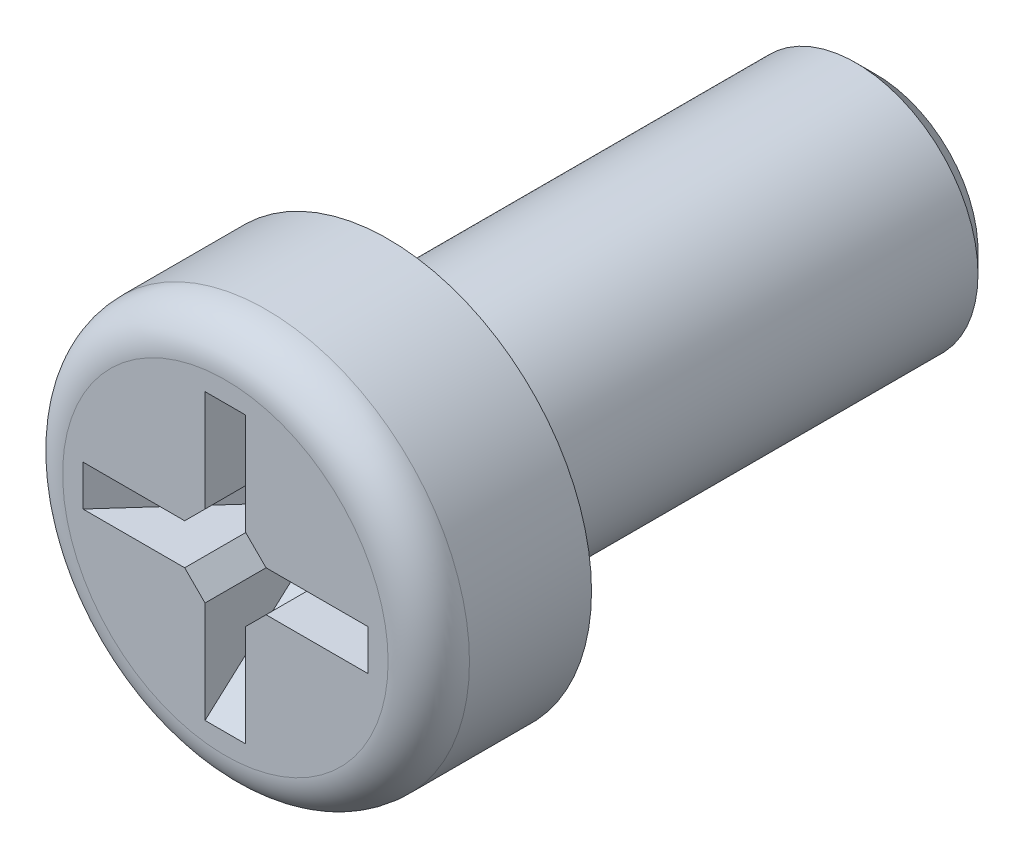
ISO-10303-21;
HEADER;
FILE_DESCRIPTION(('STEP AP214'),'2;1');
FILE_NAME('part.step','',(''),(''),'','','');
FILE_SCHEMA(('AUTOMOTIVE_DESIGN { 1 0 10303 214 1 1 1 1 }'));
ENDSEC;
DATA;
#1=APPLICATION_CONTEXT('core data for automotive mechanical design processes');
#2=APPLICATION_PROTOCOL_DEFINITION('international standard','automotive_design',2000,#1);
#3=PRODUCT_CONTEXT('',#1,'mechanical');
#4=PRODUCT('Part','Part','',(#3));
#5=PRODUCT_RELATED_PRODUCT_CATEGORY('part','',(#4));
#6=PRODUCT_DEFINITION_FORMATION('','',#4);
#7=PRODUCT_DEFINITION_CONTEXT('part definition',#1,'design');
#8=PRODUCT_DEFINITION('design','',#6,#7);
#9=PRODUCT_DEFINITION_SHAPE('','',#8);
#10=(LENGTH_UNIT() NAMED_UNIT(*) SI_UNIT(.MILLI.,.METRE.));
#11=(NAMED_UNIT(*) PLANE_ANGLE_UNIT() SI_UNIT($,.RADIAN.));
#12=(NAMED_UNIT(*) SI_UNIT($,.STERADIAN.) SOLID_ANGLE_UNIT());
#13=UNCERTAINTY_MEASURE_WITH_UNIT(LENGTH_MEASURE(1.E-05),#10,'distance_accuracy_value','');
#14=(GEOMETRIC_REPRESENTATION_CONTEXT(3) GLOBAL_UNCERTAINTY_ASSIGNED_CONTEXT((#13)) GLOBAL_UNIT_ASSIGNED_CONTEXT((#10,
#11,#12)) REPRESENTATION_CONTEXT('',''));
#15=CARTESIAN_POINT('',(0.,0.,0.));
#16=DIRECTION('',(0.,0.,1.));
#17=DIRECTION('',(1.,0.,0.));
#18=AXIS2_PLACEMENT_3D('',#15,#16,#17);
#19=CARTESIAN_POINT('',(1.75,0.25,2.));
#20=DIRECTION('',(-0.743144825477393,0.,0.669130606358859));
#21=DIRECTION('',(0.669130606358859,0.,0.743144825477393));
#22=AXIS2_PLACEMENT_3D('',#19,#20,#21);
#23=PLANE('',#22);
#24=DIRECTION('',(-0.669130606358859,0.,-0.743144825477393));
#25=VECTOR('',#24,1.);
#26=CARTESIAN_POINT('',(1.75,0.25,2.));
#27=LINE('',#26,#25);
#28=CARTESIAN_POINT('',(0.5,0.25,0.611734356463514));
#29=VERTEX_POINT('',#28);
#30=CARTESIAN_POINT('',(1.75,0.25,2.));
#31=VERTEX_POINT('',#30);
#32=EDGE_CURVE('E219',#29,#31,#27,.F.);
#33=ORIENTED_EDGE('',*,*,#32,.F.);
#34=DIRECTION('',(-0.556117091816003,0.556117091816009,-0.617630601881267));
#35=VECTOR('',#34,1.);
#36=CARTESIAN_POINT('',(1.36341722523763,-0.613417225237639,1.57065633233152));
#37=LINE('',#36,#35);
#38=CARTESIAN_POINT('',(0.375,0.375,0.472907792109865));
#39=VERTEX_POINT('',#38);
#40=EDGE_CURVE('E266',#29,#39,#37,.T.);
#41=ORIENTED_EDGE('',*,*,#40,.T.);
#42=DIRECTION('',(-0.556117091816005,-0.556117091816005,-0.617630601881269));
#43=VECTOR('',#42,1.);
#44=CARTESIAN_POINT('',(1.13146756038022,1.13146756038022,1.31305013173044));
#45=LINE('',#44,#43);
#46=CARTESIAN_POINT('',(0.0392323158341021,0.0392323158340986,0.0999999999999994));
#47=VERTEX_POINT('',#46);
#48=EDGE_CURVE('E238',#39,#47,#45,.T.);
#49=ORIENTED_EDGE('',*,*,#48,.T.);
#50=DIRECTION('',(0.,-1.,0.));
#51=VECTOR('',#50,1.);
#52=CARTESIAN_POINT('',(0.0392323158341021,-0.25,0.0999999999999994));
#53=LINE('',#52,#51);
#54=CARTESIAN_POINT('',(0.0392323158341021,-0.0392323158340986,0.0999999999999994));
#55=VERTEX_POINT('',#54);
#56=EDGE_CURVE('E222',#55,#47,#53,.F.);
#57=ORIENTED_EDGE('',*,*,#56,.F.);
#58=DIRECTION('',(-0.556117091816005,0.556117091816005,-0.617630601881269));
#59=VECTOR('',#58,1.);
#60=CARTESIAN_POINT('',(1.13146756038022,-1.13146756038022,1.31305013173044));
#61=LINE('',#60,#59);
#62=CARTESIAN_POINT('',(0.375,-0.375,0.472907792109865));
#63=VERTEX_POINT('',#62);
#64=EDGE_CURVE('E53',#63,#55,#61,.T.);
#65=ORIENTED_EDGE('',*,*,#64,.F.);
#66=DIRECTION('',(0.556117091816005,0.556117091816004,0.617630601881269));
#67=VECTOR('',#66,1.);
#68=CARTESIAN_POINT('',(1.51805033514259,0.76805033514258,1.74239379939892));
#69=LINE('',#68,#67);
#70=CARTESIAN_POINT('',(0.5,-0.25,0.611734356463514));
#71=VERTEX_POINT('',#70);
#72=EDGE_CURVE('E277',#63,#71,#69,.T.);
#73=ORIENTED_EDGE('',*,*,#72,.T.);
#74=DIRECTION('',(-0.669130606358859,0.,-0.743144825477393));
#75=VECTOR('',#74,1.);
#76=CARTESIAN_POINT('',(0.133600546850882,-0.249999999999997,0.204806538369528));
#77=LINE('',#76,#75);
#78=CARTESIAN_POINT('',(1.75,-0.25,2.));
#79=VERTEX_POINT('',#78);
#80=EDGE_CURVE('E224',#71,#79,#77,.F.);
#81=ORIENTED_EDGE('',*,*,#80,.T.);
#82=DIRECTION('',(0.,1.,0.));
#83=VECTOR('',#82,1.);
#84=CARTESIAN_POINT('',(1.75,0.25,2.));
#85=LINE('',#84,#83);
#86=EDGE_CURVE('E186',#79,#31,#85,.T.);
#87=ORIENTED_EDGE('',*,*,#86,.T.);
#88=EDGE_LOOP('',(#33,#41,#49,#57,#65,#73,#81,#87));
#89=FACE_BOUND('',#88,.T.);
#90=ADVANCED_FACE('F30',(#89),#23,.T.);
#91=CARTESIAN_POINT('',(-0.250000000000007,1.75,2.));
#92=DIRECTION('',(0.,-0.743144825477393,0.669130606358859));
#93=DIRECTION('',(0.,-0.669130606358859,-0.743144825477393));
#94=AXIS2_PLACEMENT_3D('',#91,#92,#93);
#95=PLANE('',#94);
#96=ORIENTED_EDGE('',*,*,#48,.F.);
#97=DIRECTION('',(-0.556117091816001,0.556117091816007,0.61763060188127));
#98=VECTOR('',#97,1.);
#99=CARTESIAN_POINT('',(-0.76805033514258,1.51805033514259,1.74239379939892));
#100=LINE('',#99,#98);
#101=CARTESIAN_POINT('',(0.25,0.5,0.611734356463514));
#102=VERTEX_POINT('',#101);
#103=EDGE_CURVE('E269',#39,#102,#100,.T.);
#104=ORIENTED_EDGE('',*,*,#103,.T.);
#105=DIRECTION('',(0.,-0.669130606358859,-0.743144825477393));
#106=VECTOR('',#105,1.);
#107=CARTESIAN_POINT('',(0.25,0.805204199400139,0.950697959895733));
#108=LINE('',#107,#106);
#109=CARTESIAN_POINT('',(0.250000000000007,1.75,2.));
#110=VERTEX_POINT('',#109);
#111=EDGE_CURVE('E217',#102,#110,#108,.F.);
#112=ORIENTED_EDGE('',*,*,#111,.T.);
#113=DIRECTION('',(-1.,0.,0.));
#114=VECTOR('',#113,1.);
#115=CARTESIAN_POINT('',(-0.250000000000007,1.75,2.));
#116=LINE('',#115,#114);
#117=CARTESIAN_POINT('',(-0.250000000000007,1.75,2.));
#118=VERTEX_POINT('',#117);
#119=EDGE_CURVE('E195',#110,#118,#116,.T.);
#120=ORIENTED_EDGE('',*,*,#119,.T.);
#121=DIRECTION('',(0.,-0.669130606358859,-0.743144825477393));
#122=VECTOR('',#121,1.);
#123=CARTESIAN_POINT('',(-0.250000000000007,1.75,2.));
#124=LINE('',#123,#122);
#125=CARTESIAN_POINT('',(-0.25,0.5,0.611734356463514));
#126=VERTEX_POINT('',#125);
#127=EDGE_CURVE('E203',#126,#118,#124,.F.);
#128=ORIENTED_EDGE('',*,*,#127,.F.);
#129=DIRECTION('',(-0.556117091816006,-0.556117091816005,-0.617630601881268));
#130=VECTOR('',#129,1.);
#131=CARTESIAN_POINT('',(0.613417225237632,1.36341722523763,1.57065633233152));
#132=LINE('',#131,#130);
#133=CARTESIAN_POINT('',(-0.375,0.375,0.472907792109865));
#134=VERTEX_POINT('',#133);
#135=EDGE_CURVE('E271',#126,#134,#132,.T.);
#136=ORIENTED_EDGE('',*,*,#135,.T.);
#137=DIRECTION('',(0.556117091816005,-0.556117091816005,-0.617630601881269));
#138=VECTOR('',#137,1.);
#139=CARTESIAN_POINT('',(-1.28610067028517,1.28610067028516,1.48478759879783));
#140=LINE('',#139,#138);
#141=CARTESIAN_POINT('',(-0.0392323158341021,0.0392323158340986,0.0999999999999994));
#142=VERTEX_POINT('',#141);
#143=EDGE_CURVE('E235',#134,#142,#140,.T.);
#144=ORIENTED_EDGE('',*,*,#143,.T.);
#145=DIRECTION('',(1.,0.,0.));
#146=VECTOR('',#145,1.);
#147=CARTESIAN_POINT('',(-0.25,0.0392323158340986,0.0999999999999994));
#148=LINE('',#147,#146);
#149=EDGE_CURVE('E156',#47,#142,#148,.F.);
#150=ORIENTED_EDGE('',*,*,#149,.F.);
#151=EDGE_LOOP('',(#96,#104,#112,#120,#128,#136,#144,#150));
#152=FACE_BOUND('',#151,.T.);
#153=ADVANCED_FACE('F32',(#152),#95,.T.);
#154=CARTESIAN_POINT('',(-0.250000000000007,-1.75,2.));
#155=DIRECTION('',(0.,0.743144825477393,0.669130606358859));
#156=DIRECTION('',(0.,-0.669130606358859,0.743144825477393));
#157=AXIS2_PLACEMENT_3D('',#154,#155,#156);
#158=PLANE('',#157);
#159=DIRECTION('',(0.,0.669130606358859,-0.743144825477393));
#160=VECTOR('',#159,1.);
#161=CARTESIAN_POINT('',(0.250000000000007,-1.75,2.));
#162=LINE('',#161,#160);
#163=CARTESIAN_POINT('',(0.25,-0.5,0.611734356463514));
#164=VERTEX_POINT('',#163);
#165=CARTESIAN_POINT('',(0.250000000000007,-1.75,2.));
#166=VERTEX_POINT('',#165);
#167=EDGE_CURVE('E226',#164,#166,#162,.F.);
#168=ORIENTED_EDGE('',*,*,#167,.F.);
#169=DIRECTION('',(0.556117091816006,0.556117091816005,-0.617630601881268));
#170=VECTOR('',#169,1.);
#171=CARTESIAN_POINT('',(-0.768050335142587,-1.51805033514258,1.74239379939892));
#172=LINE('',#171,#170);
#173=EDGE_CURVE('E275',#164,#63,#172,.T.);
#174=ORIENTED_EDGE('',*,*,#173,.T.);
#175=ORIENTED_EDGE('',*,*,#64,.T.);
#176=DIRECTION('',(-1.,0.,0.));
#177=VECTOR('',#176,1.);
#178=CARTESIAN_POINT('',(-0.25,-0.0392323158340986,0.0999999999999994));
#179=LINE('',#178,#177);
#180=CARTESIAN_POINT('',(-0.0392323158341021,-0.0392323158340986,0.0999999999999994));
#181=VERTEX_POINT('',#180);
#182=EDGE_CURVE('E214',#181,#55,#179,.F.);
#183=ORIENTED_EDGE('',*,*,#182,.F.);
#184=DIRECTION('',(0.556117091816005,0.556117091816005,-0.617630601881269));
#185=VECTOR('',#184,1.);
#186=CARTESIAN_POINT('',(-1.28610067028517,-1.28610067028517,1.48478759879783));
#187=LINE('',#186,#185);
#188=CARTESIAN_POINT('',(-0.375,-0.375,0.472907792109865));
#189=VERTEX_POINT('',#188);
#190=EDGE_CURVE('E45',#189,#181,#187,.T.);
#191=ORIENTED_EDGE('',*,*,#190,.F.);
#192=DIRECTION('',(0.556117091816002,-0.556117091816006,0.61763060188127));
#193=VECTOR('',#192,1.);
#194=CARTESIAN_POINT('',(0.613417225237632,-1.36341722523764,1.57065633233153));
#195=LINE('',#194,#193);
#196=CARTESIAN_POINT('',(-0.25,-0.5,0.611734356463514));
#197=VERTEX_POINT('',#196);
#198=EDGE_CURVE('E281',#189,#197,#195,.T.);
#199=ORIENTED_EDGE('',*,*,#198,.T.);
#200=DIRECTION('',(0.,0.669130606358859,-0.743144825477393));
#201=VECTOR('',#200,1.);
#202=CARTESIAN_POINT('',(-0.25,-0.133600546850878,0.204806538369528));
#203=LINE('',#202,#201);
#204=CARTESIAN_POINT('',(-0.250000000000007,-1.75,2.));
#205=VERTEX_POINT('',#204);
#206=EDGE_CURVE('E216',#197,#205,#203,.F.);
#207=ORIENTED_EDGE('',*,*,#206,.T.);
#208=DIRECTION('',(1.,0.,0.));
#209=VECTOR('',#208,1.);
#210=CARTESIAN_POINT('',(-0.250000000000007,-1.75,2.));
#211=LINE('',#210,#209);
#212=EDGE_CURVE('E177',#205,#166,#211,.T.);
#213=ORIENTED_EDGE('',*,*,#212,.T.);
#214=EDGE_LOOP('',(#168,#174,#175,#183,#191,#199,#207,#213));
#215=FACE_BOUND('',#214,.T.);
#216=ADVANCED_FACE('F303',(#215),#158,.T.);
#217=CARTESIAN_POINT('',(-1.75,0.25,2.));
#218=DIRECTION('',(0.743144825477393,0.,0.669130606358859));
#219=DIRECTION('',(0.669130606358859,0.,-0.743144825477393));
#220=AXIS2_PLACEMENT_3D('',#217,#218,#219);
#221=PLANE('',#220);
#222=ORIENTED_EDGE('',*,*,#143,.F.);
#223=DIRECTION('',(-0.556117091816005,-0.556117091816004,0.617630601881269));
#224=VECTOR('',#223,1.);
#225=CARTESIAN_POINT('',(-1.36341722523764,-0.613417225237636,1.57065633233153));
#226=LINE('',#225,#224);
#227=CARTESIAN_POINT('',(-0.5,0.25,0.611734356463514));
#228=VERTEX_POINT('',#227);
#229=EDGE_CURVE('E151',#134,#228,#226,.T.);
#230=ORIENTED_EDGE('',*,*,#229,.T.);
#231=DIRECTION('',(0.669130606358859,0.,-0.743144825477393));
#232=VECTOR('',#231,1.);
#233=CARTESIAN_POINT('',(-0.805204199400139,0.25,0.950697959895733));
#234=LINE('',#233,#232);
#235=CARTESIAN_POINT('',(-1.75,0.25,2.));
#236=VERTEX_POINT('',#235);
#237=EDGE_CURVE('E143',#228,#236,#234,.F.);
#238=ORIENTED_EDGE('',*,*,#237,.T.);
#239=DIRECTION('',(0.,-1.,0.));
#240=VECTOR('',#239,1.);
#241=CARTESIAN_POINT('',(-1.75,0.25,2.));
#242=LINE('',#241,#240);
#243=CARTESIAN_POINT('',(-1.75,-0.25,2.));
#244=VERTEX_POINT('',#243);
#245=EDGE_CURVE('E148',#236,#244,#242,.T.);
#246=ORIENTED_EDGE('',*,*,#245,.T.);
#247=DIRECTION('',(0.669130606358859,0.,-0.743144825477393));
#248=VECTOR('',#247,1.);
#249=CARTESIAN_POINT('',(-1.75,-0.25,2.));
#250=LINE('',#249,#248);
#251=CARTESIAN_POINT('',(-0.5,-0.25,0.611734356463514));
#252=VERTEX_POINT('',#251);
#253=EDGE_CURVE('E155',#252,#244,#250,.F.);
#254=ORIENTED_EDGE('',*,*,#253,.F.);
#255=DIRECTION('',(0.556117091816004,-0.556117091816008,-0.617630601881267));
#256=VECTOR('',#255,1.);
#257=CARTESIAN_POINT('',(-1.51805033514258,0.768050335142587,1.74239379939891));
#258=LINE('',#257,#256);
#259=EDGE_CURVE('E279',#252,#189,#258,.T.);
#260=ORIENTED_EDGE('',*,*,#259,.T.);
#261=ORIENTED_EDGE('',*,*,#190,.T.);
#262=DIRECTION('',(0.,1.,0.));
#263=VECTOR('',#262,1.);
#264=CARTESIAN_POINT('',(-0.0392323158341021,-0.25,0.0999999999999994));
#265=LINE('',#264,#263);
#266=EDGE_CURVE('E198',#142,#181,#265,.F.);
#267=ORIENTED_EDGE('',*,*,#266,.F.);
#268=EDGE_LOOP('',(#222,#230,#238,#246,#254,#260,#261,#267));
#269=FACE_BOUND('',#268,.T.);
#270=ADVANCED_FACE('F145',(#269),#221,.T.);
#271=CARTESIAN_POINT('',(0.,0.,0.));
#272=DIRECTION('',(0.,0.,1.));
#273=DIRECTION('',(1.,0.,0.));
#274=AXIS2_PLACEMENT_3D('',#271,#272,#273);
#275=PLANE('',#274);
#276=CARTESIAN_POINT('',(0.,0.,0.));
#277=DIRECTION('',(0.,0.,1.));
#278=DIRECTION('',(1.,0.,0.));
#279=AXIS2_PLACEMENT_3D('',#276,#277,#278);
#280=CIRCLE('',#279,2.5);
#281=CARTESIAN_POINT('',(2.5,0.,0.));
#282=VERTEX_POINT('',#281);
#283=EDGE_CURVE('E199',#282,#282,#280,.T.);
#284=ORIENTED_EDGE('',*,*,#283,.F.);
#285=EDGE_LOOP('',(#284));
#286=FACE_BOUND('',#285,.T.);
#287=CARTESIAN_POINT('',(0.,0.,0.));
#288=DIRECTION('',(0.,0.,1.));
#289=DIRECTION('',(1.,0.,0.));
#290=AXIS2_PLACEMENT_3D('',#287,#288,#289);
#291=CIRCLE('',#290,1.5);
#292=CARTESIAN_POINT('',(1.5,0.,0.));
#293=VERTEX_POINT('',#292);
#294=EDGE_CURVE('E202',#293,#293,#291,.F.);
#295=ORIENTED_EDGE('',*,*,#294,.F.);
#296=EDGE_LOOP('',(#295));
#297=FACE_BOUND('',#296,.T.);
#298=ADVANCED_FACE('F311',(#286,#297),#275,.F.);
#299=CARTESIAN_POINT('',(0.,0.,2.));
#300=DIRECTION('',(0.,0.,-1.));
#301=DIRECTION('',(-1.,0.,0.));
#302=AXIS2_PLACEMENT_3D('',#299,#300,#301);
#303=CYLINDRICAL_SURFACE('',#302,2.5);
#304=CARTESIAN_POINT('',(0.,0.,1.5));
#305=DIRECTION('',(0.,0.,1.));
#306=DIRECTION('',(1.,0.,0.));
#307=AXIS2_PLACEMENT_3D('',#304,#305,#306);
#308=CIRCLE('',#307,2.5);
#309=CARTESIAN_POINT('',(2.5,0.,1.5));
#310=VERTEX_POINT('',#309);
#311=EDGE_CURVE('E209',#310,#310,#308,.F.);
#312=ORIENTED_EDGE('',*,*,#311,.T.);
#313=EDGE_LOOP('',(#312));
#314=FACE_BOUND('',#313,.T.);
#315=ORIENTED_EDGE('',*,*,#283,.T.);
#316=EDGE_LOOP('',(#315));
#317=FACE_BOUND('',#316,.T.);
#318=ADVANCED_FACE('F312',(#314,#317),#303,.T.);
#319=CARTESIAN_POINT('',(0.,0.,2.));
#320=DIRECTION('',(0.,0.,1.));
#321=DIRECTION('',(1.,0.,0.));
#322=AXIS2_PLACEMENT_3D('',#319,#320,#321);
#323=PLANE('',#322);
#324=DIRECTION('',(0.,1.,0.));
#325=VECTOR('',#324,1.);
#326=CARTESIAN_POINT('',(0.250000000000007,1.75,2.));
#327=LINE('',#326,#325);
#328=CARTESIAN_POINT('',(0.25,0.5,2.));
#329=VERTEX_POINT('',#328);
#330=EDGE_CURVE('E192',#329,#110,#327,.T.);
#331=ORIENTED_EDGE('',*,*,#330,.F.);
#332=DIRECTION('',(-0.707106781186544,0.707106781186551,0.));
#333=VECTOR('',#332,1.);
#334=CARTESIAN_POINT('',(0.375,0.375,2.));
#335=LINE('',#334,#333);
#336=CARTESIAN_POINT('',(0.5,0.25,2.));
#337=VERTEX_POINT('',#336);
#338=EDGE_CURVE('E249',#329,#337,#335,.F.);
#339=ORIENTED_EDGE('',*,*,#338,.T.);
#340=DIRECTION('',(-1.,0.,0.));
#341=VECTOR('',#340,1.);
#342=CARTESIAN_POINT('',(0.25,0.25,2.));
#343=LINE('',#342,#341);
#344=EDGE_CURVE('E189',#31,#337,#343,.T.);
#345=ORIENTED_EDGE('',*,*,#344,.F.);
#346=ORIENTED_EDGE('',*,*,#86,.F.);
#347=DIRECTION('',(1.,0.,0.));
#348=VECTOR('',#347,1.);
#349=CARTESIAN_POINT('',(0.25,-0.25,2.));
#350=LINE('',#349,#348);
#351=CARTESIAN_POINT('',(0.5,-0.25,2.));
#352=VERTEX_POINT('',#351);
#353=EDGE_CURVE('E183',#352,#79,#350,.T.);
#354=ORIENTED_EDGE('',*,*,#353,.F.);
#355=DIRECTION('',(0.707106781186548,0.707106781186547,0.));
#356=VECTOR('',#355,1.);
#357=CARTESIAN_POINT('',(0.375,-0.375,2.));
#358=LINE('',#357,#356);
#359=CARTESIAN_POINT('',(0.25,-0.5,2.));
#360=VERTEX_POINT('',#359);
#361=EDGE_CURVE('E245',#352,#360,#358,.F.);
#362=ORIENTED_EDGE('',*,*,#361,.T.);
#363=DIRECTION('',(0.,1.,0.));
#364=VECTOR('',#363,1.);
#365=CARTESIAN_POINT('',(0.25,-0.25,2.));
#366=LINE('',#365,#364);
#367=EDGE_CURVE('E180',#166,#360,#366,.T.);
#368=ORIENTED_EDGE('',*,*,#367,.F.);
#369=ORIENTED_EDGE('',*,*,#212,.F.);
#370=DIRECTION('',(0.,-1.,0.));
#371=VECTOR('',#370,1.);
#372=CARTESIAN_POINT('',(-0.25,-0.25,2.));
#373=LINE('',#372,#371);
#374=CARTESIAN_POINT('',(-0.25,-0.5,2.));
#375=VERTEX_POINT('',#374);
#376=EDGE_CURVE('E171',#375,#205,#373,.T.);
#377=ORIENTED_EDGE('',*,*,#376,.F.);
#378=DIRECTION('',(0.707106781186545,-0.70710678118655,0.));
#379=VECTOR('',#378,1.);
#380=CARTESIAN_POINT('',(-0.375,-0.375,2.));
#381=LINE('',#380,#379);
#382=CARTESIAN_POINT('',(-0.5,-0.25,2.));
#383=VERTEX_POINT('',#382);
#384=EDGE_CURVE('E243',#375,#383,#381,.F.);
#385=ORIENTED_EDGE('',*,*,#384,.T.);
#386=DIRECTION('',(1.,0.,0.));
#387=VECTOR('',#386,1.);
#388=CARTESIAN_POINT('',(-1.75,-0.25,2.));
#389=LINE('',#388,#387);
#390=EDGE_CURVE('E169',#244,#383,#389,.T.);
#391=ORIENTED_EDGE('',*,*,#390,.F.);
#392=ORIENTED_EDGE('',*,*,#245,.F.);
#393=DIRECTION('',(-1.,0.,0.));
#394=VECTOR('',#393,1.);
#395=CARTESIAN_POINT('',(-1.75,0.25,2.));
#396=LINE('',#395,#394);
#397=CARTESIAN_POINT('',(-0.5,0.25,2.));
#398=VERTEX_POINT('',#397);
#399=EDGE_CURVE('E159',#398,#236,#396,.T.);
#400=ORIENTED_EDGE('',*,*,#399,.F.);
#401=DIRECTION('',(-0.707106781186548,-0.707106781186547,0.));
#402=VECTOR('',#401,1.);
#403=CARTESIAN_POINT('',(-0.375,0.375,2.));
#404=LINE('',#403,#402);
#405=CARTESIAN_POINT('',(-0.25,0.5,2.));
#406=VERTEX_POINT('',#405);
#407=EDGE_CURVE('E247',#398,#406,#404,.F.);
#408=ORIENTED_EDGE('',*,*,#407,.T.);
#409=DIRECTION('',(0.,-1.,0.));
#410=VECTOR('',#409,1.);
#411=CARTESIAN_POINT('',(-0.250000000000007,1.75,2.));
#412=LINE('',#411,#410);
#413=EDGE_CURVE('E163',#118,#406,#412,.T.);
#414=ORIENTED_EDGE('',*,*,#413,.F.);
#415=ORIENTED_EDGE('',*,*,#119,.F.);
#416=EDGE_LOOP('',(#331,#339,#345,#346,#354,#362,#368,#369,#377,#385,#391,#392,#400,#408,#414,#415));
#417=FACE_BOUND('',#416,.T.);
#418=CARTESIAN_POINT('',(0.,0.,2.));
#419=DIRECTION('',(0.,0.,1.));
#420=DIRECTION('',(1.,0.,0.));
#421=AXIS2_PLACEMENT_3D('',#418,#419,#420);
#422=CIRCLE('',#421,2.);
#423=CARTESIAN_POINT('',(2.,0.,2.));
#424=VERTEX_POINT('',#423);
#425=EDGE_CURVE('E206',#424,#424,#422,.T.);
#426=ORIENTED_EDGE('',*,*,#425,.T.);
#427=EDGE_LOOP('',(#426));
#428=FACE_BOUND('',#427,.T.);
#429=ADVANCED_FACE('F166',(#417,#428),#323,.T.);
#430=CARTESIAN_POINT('',(0.,0.,-6.));
#431=DIRECTION('',(0.,0.,1.));
#432=DIRECTION('',(1.,0.,0.));
#433=AXIS2_PLACEMENT_3D('',#430,#431,#432);
#434=CYLINDRICAL_SURFACE('',#433,1.5);
#435=CARTESIAN_POINT('',(0.,0.,-5.75));
#436=DIRECTION('',(0.,0.,-1.));
#437=DIRECTION('',(-1.,0.,0.));
#438=AXIS2_PLACEMENT_3D('',#435,#436,#437);
#439=CIRCLE('',#438,1.5);
#440=CARTESIAN_POINT('',(-1.5,0.,-5.75));
#441=VERTEX_POINT('',#440);
#442=EDGE_CURVE('E11',#441,#441,#439,.F.);
#443=ORIENTED_EDGE('',*,*,#442,.T.);
#444=EDGE_LOOP('',(#443));
#445=FACE_BOUND('',#444,.T.);
#446=ORIENTED_EDGE('',*,*,#294,.T.);
#447=EDGE_LOOP('',(#446));
#448=FACE_BOUND('',#447,.T.);
#449=ADVANCED_FACE('F318',(#445,#448),#434,.T.);
#450=CARTESIAN_POINT('',(0.,0.,-6.));
#451=DIRECTION('',(0.,0.,-1.));
#452=DIRECTION('',(-1.,0.,0.));
#453=AXIS2_PLACEMENT_3D('',#450,#451,#452);
#454=PLANE('',#453);
#455=CARTESIAN_POINT('',(0.,0.,-6.));
#456=DIRECTION('',(0.,0.,-1.));
#457=DIRECTION('',(-1.,0.,0.));
#458=AXIS2_PLACEMENT_3D('',#455,#456,#457);
#459=CIRCLE('',#458,1.25);
#460=CARTESIAN_POINT('',(-1.25,0.,-6.));
#461=VERTEX_POINT('',#460);
#462=EDGE_CURVE('E38',#461,#461,#459,.T.);
#463=ORIENTED_EDGE('',*,*,#462,.T.);
#464=EDGE_LOOP('',(#463));
#465=FACE_BOUND('',#464,.T.);
#466=ADVANCED_FACE('F285',(#465),#454,.T.);
#467=CARTESIAN_POINT('',(0.,0.,1.5));
#468=DIRECTION('',(0.,0.,1.));
#469=DIRECTION('',(1.,0.,0.));
#470=AXIS2_PLACEMENT_3D('',#467,#468,#469);
#471=TOROIDAL_SURFACE('',#470,2.,0.5);
#472=ORIENTED_EDGE('',*,*,#311,.F.);
#473=EDGE_LOOP('',(#472));
#474=FACE_BOUND('',#473,.T.);
#475=ORIENTED_EDGE('',*,*,#425,.F.);
#476=EDGE_LOOP('',(#475));
#477=FACE_BOUND('',#476,.T.);
#478=ADVANCED_FACE('F327',(#474,#477),#471,.T.);
#479=CARTESIAN_POINT('',(-0.250000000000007,1.75,0.0999999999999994));
#480=DIRECTION('',(-1.,0.,0.));
#481=DIRECTION('',(0.,-1.,0.));
#482=AXIS2_PLACEMENT_3D('',#479,#480,#481);
#483=PLANE('',#482);
#484=ORIENTED_EDGE('',*,*,#413,.T.);
#485=DIRECTION('',(0.,0.,-1.));
#486=VECTOR('',#485,1.);
#487=CARTESIAN_POINT('',(-0.25,0.5,0.0999999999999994));
#488=LINE('',#487,#486);
#489=EDGE_CURVE('E254',#406,#126,#488,.T.);
#490=ORIENTED_EDGE('',*,*,#489,.T.);
#491=ORIENTED_EDGE('',*,*,#127,.T.);
#492=EDGE_LOOP('',(#484,#490,#491));
#493=FACE_BOUND('',#492,.T.);
#494=ADVANCED_FACE('F330',(#493),#483,.F.);
#495=CARTESIAN_POINT('',(0.250000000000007,1.75,0.0999999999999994));
#496=DIRECTION('',(1.,0.,0.));
#497=DIRECTION('',(0.,1.,0.));
#498=AXIS2_PLACEMENT_3D('',#495,#496,#497);
#499=PLANE('',#498);
#500=ORIENTED_EDGE('',*,*,#111,.F.);
#501=DIRECTION('',(0.,0.,1.));
#502=VECTOR('',#501,1.);
#503=CARTESIAN_POINT('',(0.25,0.5,0.0999999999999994));
#504=LINE('',#503,#502);
#505=EDGE_CURVE('E240',#102,#329,#504,.T.);
#506=ORIENTED_EDGE('',*,*,#505,.T.);
#507=ORIENTED_EDGE('',*,*,#330,.T.);
#508=EDGE_LOOP('',(#500,#506,#507));
#509=FACE_BOUND('',#508,.T.);
#510=ADVANCED_FACE('F334',(#509),#499,.F.);
#511=CARTESIAN_POINT('',(0.25,0.25,0.0999999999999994));
#512=DIRECTION('',(0.,1.,0.));
#513=DIRECTION('',(-1.,0.,0.));
#514=AXIS2_PLACEMENT_3D('',#511,#512,#513);
#515=PLANE('',#514);
#516=ORIENTED_EDGE('',*,*,#344,.T.);
#517=DIRECTION('',(0.,0.,-1.));
#518=VECTOR('',#517,1.);
#519=CARTESIAN_POINT('',(0.5,0.25,0.0999999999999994));
#520=LINE('',#519,#518);
#521=EDGE_CURVE('E251',#337,#29,#520,.T.);
#522=ORIENTED_EDGE('',*,*,#521,.T.);
#523=ORIENTED_EDGE('',*,*,#32,.T.);
#524=EDGE_LOOP('',(#516,#522,#523));
#525=FACE_BOUND('',#524,.T.);
#526=ADVANCED_FACE('F354',(#525),#515,.F.);
#527=CARTESIAN_POINT('',(0.25,-0.25,0.0999999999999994));
#528=DIRECTION('',(0.,-1.,0.));
#529=DIRECTION('',(1.,0.,0.));
#530=AXIS2_PLACEMENT_3D('',#527,#528,#529);
#531=PLANE('',#530);
#532=ORIENTED_EDGE('',*,*,#80,.F.);
#533=DIRECTION('',(0.,0.,1.));
#534=VECTOR('',#533,1.);
#535=CARTESIAN_POINT('',(0.5,-0.25,0.0999999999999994));
#536=LINE('',#535,#534);
#537=EDGE_CURVE('E256',#71,#352,#536,.T.);
#538=ORIENTED_EDGE('',*,*,#537,.T.);
#539=ORIENTED_EDGE('',*,*,#353,.T.);
#540=EDGE_LOOP('',(#532,#538,#539));
#541=FACE_BOUND('',#540,.T.);
#542=ADVANCED_FACE('F350',(#541),#531,.F.);
#543=CARTESIAN_POINT('',(0.25,-0.25,0.0999999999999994));
#544=DIRECTION('',(1.,0.,0.));
#545=DIRECTION('',(0.,1.,0.));
#546=AXIS2_PLACEMENT_3D('',#543,#544,#545);
#547=PLANE('',#546);
#548=ORIENTED_EDGE('',*,*,#367,.T.);
#549=DIRECTION('',(0.,0.,-1.));
#550=VECTOR('',#549,1.);
#551=CARTESIAN_POINT('',(0.25,-0.5,0.0999999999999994));
#552=LINE('',#551,#550);
#553=EDGE_CURVE('E259',#360,#164,#552,.T.);
#554=ORIENTED_EDGE('',*,*,#553,.T.);
#555=ORIENTED_EDGE('',*,*,#167,.T.);
#556=EDGE_LOOP('',(#548,#554,#555));
#557=FACE_BOUND('',#556,.T.);
#558=ADVANCED_FACE('F346',(#557),#547,.F.);
#559=CARTESIAN_POINT('',(-0.25,-0.25,0.0999999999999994));
#560=DIRECTION('',(-1.,0.,0.));
#561=DIRECTION('',(0.,-1.,0.));
#562=AXIS2_PLACEMENT_3D('',#559,#560,#561);
#563=PLANE('',#562);
#564=ORIENTED_EDGE('',*,*,#206,.F.);
#565=DIRECTION('',(0.,0.,1.));
#566=VECTOR('',#565,1.);
#567=CARTESIAN_POINT('',(-0.25,-0.5,0.0999999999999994));
#568=LINE('',#567,#566);
#569=EDGE_CURVE('E261',#197,#375,#568,.T.);
#570=ORIENTED_EDGE('',*,*,#569,.T.);
#571=ORIENTED_EDGE('',*,*,#376,.T.);
#572=EDGE_LOOP('',(#564,#570,#571));
#573=FACE_BOUND('',#572,.T.);
#574=ADVANCED_FACE('F342',(#573),#563,.F.);
#575=CARTESIAN_POINT('',(-1.75,-0.25,0.0999999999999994));
#576=DIRECTION('',(0.,-1.,0.));
#577=DIRECTION('',(1.,0.,0.));
#578=AXIS2_PLACEMENT_3D('',#575,#576,#577);
#579=PLANE('',#578);
#580=ORIENTED_EDGE('',*,*,#390,.T.);
#581=DIRECTION('',(0.,0.,-1.));
#582=VECTOR('',#581,1.);
#583=CARTESIAN_POINT('',(-0.5,-0.25,0.0999999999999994));
#584=LINE('',#583,#582);
#585=EDGE_CURVE('E264',#383,#252,#584,.T.);
#586=ORIENTED_EDGE('',*,*,#585,.T.);
#587=ORIENTED_EDGE('',*,*,#253,.T.);
#588=EDGE_LOOP('',(#580,#586,#587));
#589=FACE_BOUND('',#588,.T.);
#590=ADVANCED_FACE('F339',(#589),#579,.F.);
#591=CARTESIAN_POINT('',(-1.75,0.25,0.0999999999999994));
#592=DIRECTION('',(0.,1.,0.));
#593=DIRECTION('',(-1.,0.,0.));
#594=AXIS2_PLACEMENT_3D('',#591,#592,#593);
#595=PLANE('',#594);
#596=ORIENTED_EDGE('',*,*,#237,.F.);
#597=DIRECTION('',(0.,0.,1.));
#598=VECTOR('',#597,1.);
#599=CARTESIAN_POINT('',(-0.5,0.25,0.0999999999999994));
#600=LINE('',#599,#598);
#601=EDGE_CURVE('E161',#228,#398,#600,.T.);
#602=ORIENTED_EDGE('',*,*,#601,.T.);
#603=ORIENTED_EDGE('',*,*,#399,.T.);
#604=EDGE_LOOP('',(#596,#602,#603));
#605=FACE_BOUND('',#604,.T.);
#606=ADVANCED_FACE('F160',(#605),#595,.F.);
#607=CARTESIAN_POINT('',(-0.25,-0.25,0.0999999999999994));
#608=DIRECTION('',(0.,0.,1.));
#609=DIRECTION('',(1.,0.,0.));
#610=AXIS2_PLACEMENT_3D('',#607,#608,#609);
#611=PLANE('',#610);
#612=ORIENTED_EDGE('',*,*,#149,.T.);
#613=ORIENTED_EDGE('',*,*,#266,.T.);
#614=ORIENTED_EDGE('',*,*,#182,.T.);
#615=ORIENTED_EDGE('',*,*,#56,.T.);
#616=EDGE_LOOP('',(#612,#613,#614,#615));
#617=FACE_BOUND('',#616,.T.);
#618=ADVANCED_FACE('F338',(#617),#611,.T.);
#619=CARTESIAN_POINT('',(0.25,0.5,0.0999999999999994));
#620=DIRECTION('',(0.707106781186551,0.707106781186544,0.));
#621=DIRECTION('',(-0.707106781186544,0.707106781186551,0.));
#622=AXIS2_PLACEMENT_3D('',#619,#620,#621);
#623=PLANE('',#622);
#624=ORIENTED_EDGE('',*,*,#40,.F.);
#625=ORIENTED_EDGE('',*,*,#521,.F.);
#626=ORIENTED_EDGE('',*,*,#338,.F.);
#627=ORIENTED_EDGE('',*,*,#505,.F.);
#628=ORIENTED_EDGE('',*,*,#103,.F.);
#629=EDGE_LOOP('',(#624,#625,#626,#627,#628));
#630=FACE_BOUND('',#629,.T.);
#631=ADVANCED_FACE('F364',(#630),#623,.F.);
#632=CARTESIAN_POINT('',(-0.5,0.25,0.0999999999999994));
#633=DIRECTION('',(-0.707106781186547,0.707106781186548,0.));
#634=DIRECTION('',(-0.707106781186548,-0.707106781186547,0.));
#635=AXIS2_PLACEMENT_3D('',#632,#633,#634);
#636=PLANE('',#635);
#637=ORIENTED_EDGE('',*,*,#135,.F.);
#638=ORIENTED_EDGE('',*,*,#489,.F.);
#639=ORIENTED_EDGE('',*,*,#407,.F.);
#640=ORIENTED_EDGE('',*,*,#601,.F.);
#641=ORIENTED_EDGE('',*,*,#229,.F.);
#642=EDGE_LOOP('',(#637,#638,#639,#640,#641));
#643=FACE_BOUND('',#642,.T.);
#644=ADVANCED_FACE('F368',(#643),#636,.F.);
#645=CARTESIAN_POINT('',(0.5,-0.25,0.0999999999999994));
#646=DIRECTION('',(0.707106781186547,-0.707106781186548,0.));
#647=DIRECTION('',(0.707106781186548,0.707106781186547,0.));
#648=AXIS2_PLACEMENT_3D('',#645,#646,#647);
#649=PLANE('',#648);
#650=ORIENTED_EDGE('',*,*,#173,.F.);
#651=ORIENTED_EDGE('',*,*,#553,.F.);
#652=ORIENTED_EDGE('',*,*,#361,.F.);
#653=ORIENTED_EDGE('',*,*,#537,.F.);
#654=ORIENTED_EDGE('',*,*,#72,.F.);
#655=EDGE_LOOP('',(#650,#651,#652,#653,#654));
#656=FACE_BOUND('',#655,.T.);
#657=ADVANCED_FACE('F295',(#656),#649,.F.);
#658=CARTESIAN_POINT('',(-0.25,-0.5,0.0999999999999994));
#659=DIRECTION('',(-0.70710678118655,-0.707106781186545,0.));
#660=DIRECTION('',(0.707106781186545,-0.70710678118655,0.));
#661=AXIS2_PLACEMENT_3D('',#658,#659,#660);
#662=PLANE('',#661);
#663=ORIENTED_EDGE('',*,*,#259,.F.);
#664=ORIENTED_EDGE('',*,*,#585,.F.);
#665=ORIENTED_EDGE('',*,*,#384,.F.);
#666=ORIENTED_EDGE('',*,*,#569,.F.);
#667=ORIENTED_EDGE('',*,*,#198,.F.);
#668=EDGE_LOOP('',(#663,#664,#665,#666,#667));
#669=FACE_BOUND('',#668,.T.);
#670=ADVANCED_FACE('F289',(#669),#662,.F.);
#671=CARTESIAN_POINT('',(0.,0.,-6.));
#672=DIRECTION('',(0.,0.,1.));
#673=DIRECTION('',(1.,0.,0.));
#674=AXIS2_PLACEMENT_3D('',#671,#672,#673);
#675=CONICAL_SURFACE('',#674,1.25,0.785398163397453);
#676=ORIENTED_EDGE('',*,*,#442,.F.);
#677=EDGE_LOOP('',(#676));
#678=FACE_BOUND('',#677,.T.);
#679=ORIENTED_EDGE('',*,*,#462,.F.);
#680=EDGE_LOOP('',(#679));
#681=FACE_BOUND('',#680,.T.);
#682=ADVANCED_FACE('F287',(#678,#681),#675,.T.);
#683=CLOSED_SHELL('',(#90,#153,#216,#270,#298,#318,#429,#449,#466,#478,#494,#510,#526,#542,#558,
#574,#590,#606,#618,#631,#644,#657,#670,#682));
#684=MANIFOLD_SOLID_BREP('B2',#683);
#685=ADVANCED_BREP_SHAPE_REPRESENTATION('',(#18,#684),#14);
#686=SHAPE_DEFINITION_REPRESENTATION(#9,#685);
ENDSEC;
END-ISO-10303-21;
